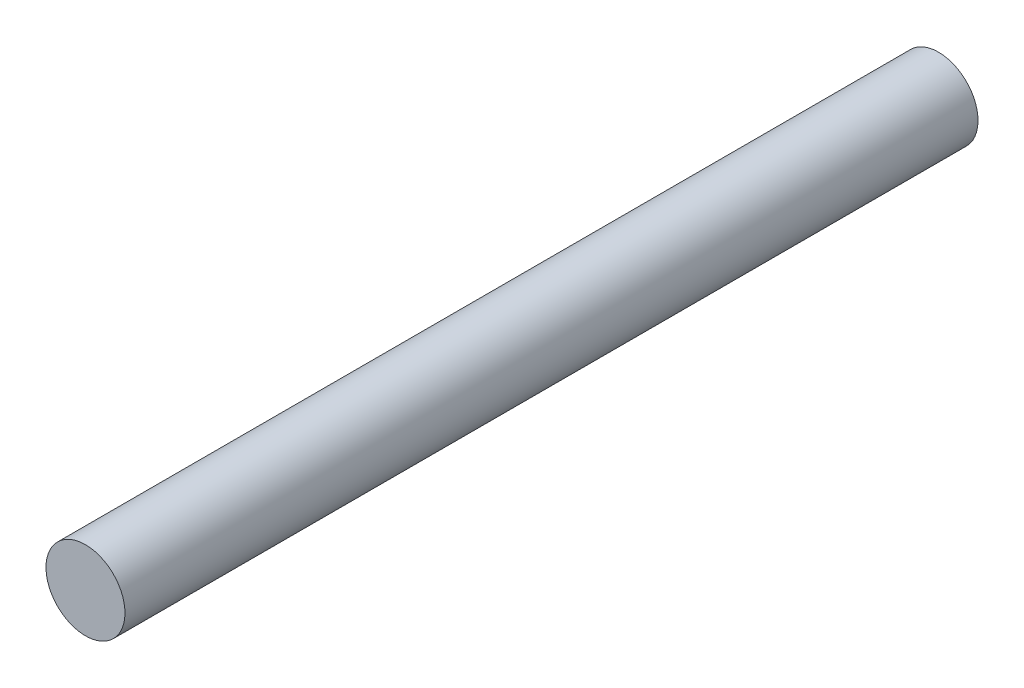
ISO-10303-21;
HEADER;
FILE_DESCRIPTION(('STEP AP214'),'2;1');
FILE_NAME('part.step','',(''),(''),'','','');
FILE_SCHEMA(('AUTOMOTIVE_DESIGN { 1 0 10303 214 1 1 1 1 }'));
ENDSEC;
DATA;
#1=APPLICATION_CONTEXT('core data for automotive mechanical design processes');
#2=APPLICATION_PROTOCOL_DEFINITION('international standard','automotive_design',2000,#1);
#3=PRODUCT_CONTEXT('',#1,'mechanical');
#4=PRODUCT('Part','Part','',(#3));
#5=PRODUCT_RELATED_PRODUCT_CATEGORY('part','',(#4));
#6=PRODUCT_DEFINITION_FORMATION('','',#4);
#7=PRODUCT_DEFINITION_CONTEXT('part definition',#1,'design');
#8=PRODUCT_DEFINITION('design','',#6,#7);
#9=PRODUCT_DEFINITION_SHAPE('','',#8);
#10=(LENGTH_UNIT() NAMED_UNIT(*) SI_UNIT(.MILLI.,.METRE.));
#11=(NAMED_UNIT(*) PLANE_ANGLE_UNIT() SI_UNIT($,.RADIAN.));
#12=(NAMED_UNIT(*) SI_UNIT($,.STERADIAN.) SOLID_ANGLE_UNIT());
#13=UNCERTAINTY_MEASURE_WITH_UNIT(LENGTH_MEASURE(1.E-05),#10,'distance_accuracy_value','');
#14=(GEOMETRIC_REPRESENTATION_CONTEXT(3) GLOBAL_UNCERTAINTY_ASSIGNED_CONTEXT((#13)) GLOBAL_UNIT_ASSIGNED_CONTEXT((#10,
#11,#12)) REPRESENTATION_CONTEXT('',''));
#15=CARTESIAN_POINT('',(0.,0.,0.));
#16=DIRECTION('',(0.,0.,1.));
#17=DIRECTION('',(1.,0.,0.));
#18=AXIS2_PLACEMENT_3D('',#15,#16,#17);
#19=CARTESIAN_POINT('',(0.,0.,324.));
#20=DIRECTION('',(0.,0.,1.));
#21=DIRECTION('',(0.,1.,0.));
#22=AXIS2_PLACEMENT_3D('',#19,#20,#21);
#23=PLANE('',#22);
#24=CARTESIAN_POINT('',(0.,0.,324.));
#25=DIRECTION('',(0.,0.,1.));
#26=DIRECTION('',(0.,1.,0.));
#27=AXIS2_PLACEMENT_3D('',#24,#25,#26);
#28=CIRCLE('',#27,15.);
#29=CARTESIAN_POINT('',(0.,15.,324.));
#30=VERTEX_POINT('',#29);
#31=EDGE_CURVE('E8',#30,#30,#28,.T.);
#32=ORIENTED_EDGE('',*,*,#31,.T.);
#33=EDGE_LOOP('',(#32));
#34=FACE_BOUND('',#33,.T.);
#35=ADVANCED_FACE('F12',(#34),#23,.T.);
#36=CARTESIAN_POINT('',(0.,0.,324.));
#37=DIRECTION('',(0.,0.,-1.));
#38=DIRECTION('',(0.,-1.,0.));
#39=AXIS2_PLACEMENT_3D('',#36,#37,#38);
#40=CYLINDRICAL_SURFACE('',#39,15.);
#41=ORIENTED_EDGE('',*,*,#31,.F.);
#42=EDGE_LOOP('',(#41));
#43=FACE_BOUND('',#42,.T.);
#44=CARTESIAN_POINT('',(0.,0.,0.));
#45=DIRECTION('',(0.,0.,1.));
#46=DIRECTION('',(0.,1.,0.));
#47=AXIS2_PLACEMENT_3D('',#44,#45,#46);
#48=CIRCLE('',#47,15.);
#49=CARTESIAN_POINT('',(0.,15.,0.));
#50=VERTEX_POINT('',#49);
#51=EDGE_CURVE('E16',#50,#50,#48,.T.);
#52=ORIENTED_EDGE('',*,*,#51,.T.);
#53=EDGE_LOOP('',(#52));
#54=FACE_BOUND('',#53,.T.);
#55=ADVANCED_FACE('F14',(#43,#54),#40,.T.);
#56=CARTESIAN_POINT('',(0.,0.,0.));
#57=DIRECTION('',(0.,0.,1.));
#58=DIRECTION('',(0.,1.,0.));
#59=AXIS2_PLACEMENT_3D('',#56,#57,#58);
#60=PLANE('',#59);
#61=ORIENTED_EDGE('',*,*,#51,.F.);
#62=EDGE_LOOP('',(#61));
#63=FACE_BOUND('',#62,.T.);
#64=ADVANCED_FACE('F26',(#63),#60,.F.);
#65=CLOSED_SHELL('',(#35,#55,#64));
#66=MANIFOLD_SOLID_BREP('B1',#65);
#67=ADVANCED_BREP_SHAPE_REPRESENTATION('',(#18,#66),#14);
#68=SHAPE_DEFINITION_REPRESENTATION(#9,#67);
ENDSEC;
END-ISO-10303-21;
